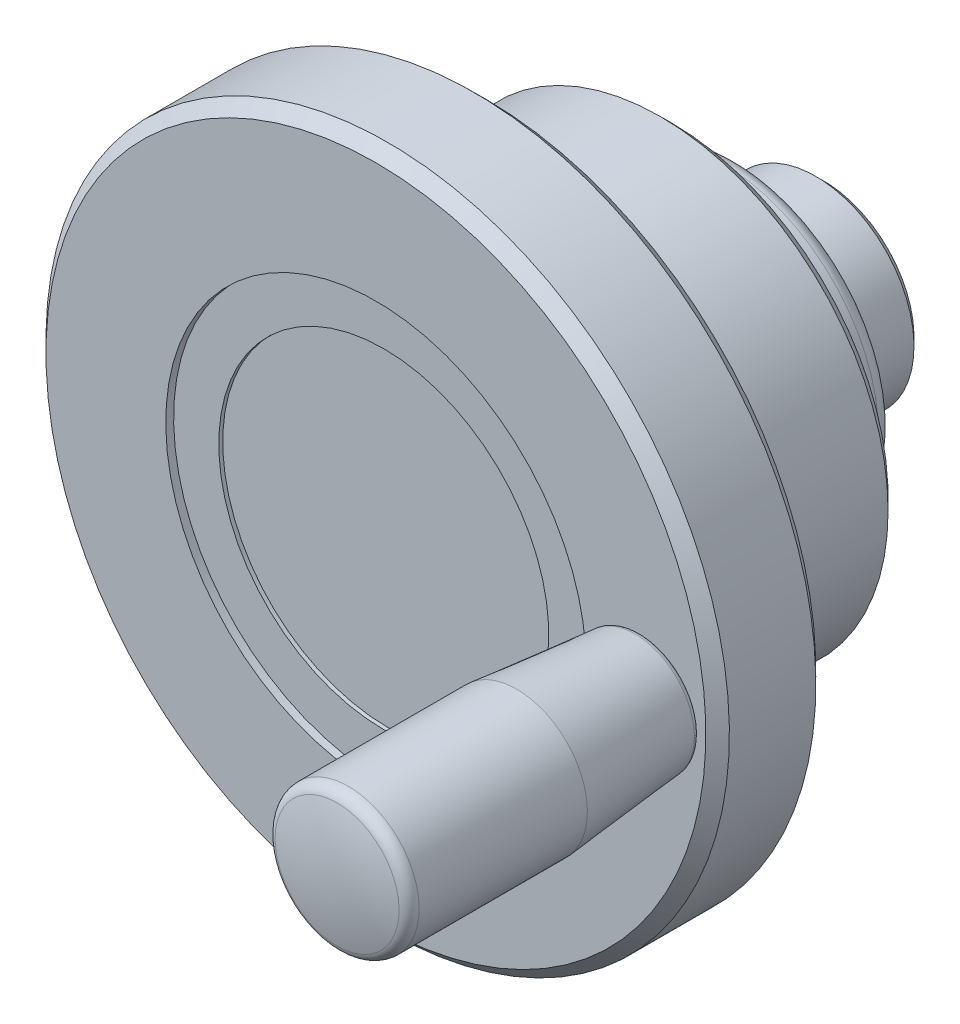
ISO-10303-21;
HEADER;
FILE_DESCRIPTION(('STEP AP214'),'2;1');
FILE_NAME('part.step','',(''),(''),'','','');
FILE_SCHEMA(('AUTOMOTIVE_DESIGN { 1 0 10303 214 1 1 1 1 }'));
ENDSEC;
DATA;
#1=APPLICATION_CONTEXT('core data for automotive mechanical design processes');
#2=APPLICATION_PROTOCOL_DEFINITION('international standard','automotive_design',2000,#1);
#3=PRODUCT_CONTEXT('',#1,'mechanical');
#4=PRODUCT('Part','Part','',(#3));
#5=PRODUCT_RELATED_PRODUCT_CATEGORY('part','',(#4));
#6=PRODUCT_DEFINITION_FORMATION('','',#4);
#7=PRODUCT_DEFINITION_CONTEXT('part definition',#1,'design');
#8=PRODUCT_DEFINITION('design','',#6,#7);
#9=PRODUCT_DEFINITION_SHAPE('','',#8);
#10=(LENGTH_UNIT() NAMED_UNIT(*) SI_UNIT(.MILLI.,.METRE.));
#11=(NAMED_UNIT(*) PLANE_ANGLE_UNIT() SI_UNIT($,.RADIAN.));
#12=(NAMED_UNIT(*) SI_UNIT($,.STERADIAN.) SOLID_ANGLE_UNIT());
#13=UNCERTAINTY_MEASURE_WITH_UNIT(LENGTH_MEASURE(1.E-05),#10,'distance_accuracy_value','');
#14=(GEOMETRIC_REPRESENTATION_CONTEXT(3) GLOBAL_UNCERTAINTY_ASSIGNED_CONTEXT((#13)) GLOBAL_UNIT_ASSIGNED_CONTEXT((#10,
#11,#12)) REPRESENTATION_CONTEXT('',''));
#15=CARTESIAN_POINT('',(0.,0.,0.));
#16=DIRECTION('',(0.,0.,1.));
#17=DIRECTION('',(1.,0.,0.));
#18=AXIS2_PLACEMENT_3D('',#15,#16,#17);
#19=CARTESIAN_POINT('',(-42.,0.,57.));
#20=DIRECTION('',(0.,0.,-1.));
#21=DIRECTION('',(0.,1.,0.));
#22=AXIS2_PLACEMENT_3D('',#19,#20,#21);
#23=PLANE('',#22);
#24=CARTESIAN_POINT('',(0.,0.,57.));
#25=DIRECTION('',(0.,0.,1.));
#26=DIRECTION('',(0.,-1.,0.));
#27=AXIS2_PLACEMENT_3D('',#24,#25,#26);
#28=CIRCLE('',#27,42.);
#29=CARTESIAN_POINT('',(0.,-42.,57.));
#30=VERTEX_POINT('',#29);
#31=EDGE_CURVE('E16',#30,#30,#28,.T.);
#32=ORIENTED_EDGE('',*,*,#31,.T.);
#33=EDGE_LOOP('',(#32));
#34=FACE_BOUND('',#33,.T.);
#35=CARTESIAN_POINT('',(0.,0.,57.));
#36=DIRECTION('',(0.,0.,1.));
#37=DIRECTION('',(0.,-1.,0.));
#38=AXIS2_PLACEMENT_3D('',#35,#36,#37);
#39=CIRCLE('',#38,26.75);
#40=CARTESIAN_POINT('',(0.,-26.75,57.));
#41=VERTEX_POINT('',#40);
#42=EDGE_CURVE('E50',#41,#41,#39,.T.);
#43=ORIENTED_EDGE('',*,*,#42,.F.);
#44=EDGE_LOOP('',(#43));
#45=FACE_BOUND('',#44,.T.);
#46=CARTESIAN_POINT('',(34.,0.,57.));
#47=DIRECTION('',(0.,0.,1.));
#48=DIRECTION('',(0.,-1.,0.));
#49=AXIS2_PLACEMENT_3D('',#46,#47,#48);
#50=CIRCLE('',#49,5.);
#51=CARTESIAN_POINT('',(34.,-5.,57.));
#52=VERTEX_POINT('',#51);
#53=EDGE_CURVE('E8',#52,#52,#50,.T.);
#54=ORIENTED_EDGE('',*,*,#53,.F.);
#55=EDGE_LOOP('',(#54));
#56=FACE_BOUND('',#55,.T.);
#57=ADVANCED_FACE('F12',(#34,#45,#56),#23,.F.);
#58=CARTESIAN_POINT('',(0.,0.,0.));
#59=DIRECTION('',(0.,0.,1.));
#60=DIRECTION('',(0.,-1.,0.));
#61=AXIS2_PLACEMENT_3D('',#58,#59,#60);
#62=PLANE('',#61);
#63=CARTESIAN_POINT('',(0.,0.,0.));
#64=DIRECTION('',(0.,0.,1.));
#65=DIRECTION('',(0.,-1.,0.));
#66=AXIS2_PLACEMENT_3D('',#63,#64,#65);
#67=CIRCLE('',#66,11.5);
#68=CARTESIAN_POINT('',(0.,-11.5,0.));
#69=VERTEX_POINT('',#68);
#70=EDGE_CURVE('E56',#69,#69,#67,.T.);
#71=ORIENTED_EDGE('',*,*,#70,.F.);
#72=EDGE_LOOP('',(#71));
#73=FACE_BOUND('',#72,.T.);
#74=ADVANCED_FACE('F14',(#73),#62,.F.);
#75=CARTESIAN_POINT('',(0.,0.,55.5));
#76=DIRECTION('',(0.,0.,-1.));
#77=DIRECTION('',(0.,1.,0.));
#78=AXIS2_PLACEMENT_3D('',#75,#76,#77);
#79=CONICAL_SURFACE('',#78,43.5,0.785398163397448);
#80=ORIENTED_EDGE('',*,*,#31,.F.);
#81=EDGE_LOOP('',(#80));
#82=FACE_BOUND('',#81,.T.);
#83=CARTESIAN_POINT('',(0.,0.,55.5));
#84=DIRECTION('',(0.,0.,1.));
#85=DIRECTION('',(0.,-1.,0.));
#86=AXIS2_PLACEMENT_3D('',#83,#84,#85);
#87=CIRCLE('',#86,43.5);
#88=CARTESIAN_POINT('',(0.,-43.5,55.5));
#89=VERTEX_POINT('',#88);
#90=EDGE_CURVE('E24',#89,#89,#87,.T.);
#91=ORIENTED_EDGE('',*,*,#90,.T.);
#92=EDGE_LOOP('',(#91));
#93=FACE_BOUND('',#92,.T.);
#94=ADVANCED_FACE('F97',(#82,#93),#79,.T.);
#95=CARTESIAN_POINT('',(0.,0.,70.104900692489));
#96=DIRECTION('',(0.,0.,1.));
#97=DIRECTION('',(0.,-1.,0.));
#98=AXIS2_PLACEMENT_3D('',#95,#96,#97);
#99=CYLINDRICAL_SURFACE('',#98,43.5);
#100=ORIENTED_EDGE('',*,*,#90,.F.);
#101=EDGE_LOOP('',(#100));
#102=FACE_BOUND('',#101,.T.);
#103=CARTESIAN_POINT('',(0.,0.,44.5));
#104=DIRECTION('',(0.,0.,1.));
#105=DIRECTION('',(0.,-1.,0.));
#106=AXIS2_PLACEMENT_3D('',#103,#104,#105);
#107=CIRCLE('',#106,43.5);
#108=CARTESIAN_POINT('',(0.,-43.5,44.5));
#109=VERTEX_POINT('',#108);
#110=EDGE_CURVE('E92',#109,#109,#107,.T.);
#111=ORIENTED_EDGE('',*,*,#110,.T.);
#112=EDGE_LOOP('',(#111));
#113=FACE_BOUND('',#112,.T.);
#114=ADVANCED_FACE('F99',(#102,#113),#99,.T.);
#115=CARTESIAN_POINT('',(0.,0.,43.));
#116=DIRECTION('',(0.,0.,1.));
#117=DIRECTION('',(0.,-1.,0.));
#118=AXIS2_PLACEMENT_3D('',#115,#116,#117);
#119=CONICAL_SURFACE('',#118,42.,0.785398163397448);
#120=ORIENTED_EDGE('',*,*,#110,.F.);
#121=EDGE_LOOP('',(#120));
#122=FACE_BOUND('',#121,.T.);
#123=CARTESIAN_POINT('',(0.,0.,43.));
#124=DIRECTION('',(0.,0.,1.));
#125=DIRECTION('',(0.,-1.,0.));
#126=AXIS2_PLACEMENT_3D('',#123,#124,#125);
#127=CIRCLE('',#126,42.);
#128=CARTESIAN_POINT('',(0.,-42.,43.));
#129=VERTEX_POINT('',#128);
#130=EDGE_CURVE('E89',#129,#129,#127,.T.);
#131=ORIENTED_EDGE('',*,*,#130,.T.);
#132=EDGE_LOOP('',(#131));
#133=FACE_BOUND('',#132,.T.);
#134=ADVANCED_FACE('F102',(#122,#133),#119,.T.);
#135=CARTESIAN_POINT('',(-42.,0.,43.));
#136=DIRECTION('',(0.,0.,-1.));
#137=DIRECTION('',(0.,1.,0.));
#138=AXIS2_PLACEMENT_3D('',#135,#136,#137);
#139=PLANE('',#138);
#140=CARTESIAN_POINT('',(0.,0.,43.));
#141=DIRECTION('',(0.,0.,1.));
#142=DIRECTION('',(0.,-1.,0.));
#143=AXIS2_PLACEMENT_3D('',#140,#141,#142);
#144=CIRCLE('',#143,31.);
#145=CARTESIAN_POINT('',(0.,-31.,43.));
#146=VERTEX_POINT('',#145);
#147=EDGE_CURVE('E86',#146,#146,#144,.T.);
#148=ORIENTED_EDGE('',*,*,#147,.T.);
#149=EDGE_LOOP('',(#148));
#150=FACE_BOUND('',#149,.T.);
#151=ORIENTED_EDGE('',*,*,#130,.F.);
#152=EDGE_LOOP('',(#151));
#153=FACE_BOUND('',#152,.T.);
#154=ADVANCED_FACE('F108',(#150,#153),#139,.T.);
#155=CARTESIAN_POINT('',(0.,0.,41.));
#156=DIRECTION('',(0.,0.,1.));
#157=DIRECTION('',(0.,-1.,0.));
#158=AXIS2_PLACEMENT_3D('',#155,#156,#157);
#159=TOROIDAL_SURFACE('',#158,31.,2.);
#160=ORIENTED_EDGE('',*,*,#147,.F.);
#161=EDGE_LOOP('',(#160));
#162=FACE_BOUND('',#161,.T.);
#163=CARTESIAN_POINT('',(0.,0.,41.));
#164=DIRECTION('',(0.,0.,1.));
#165=DIRECTION('',(0.,-1.,0.));
#166=AXIS2_PLACEMENT_3D('',#163,#164,#165);
#167=CIRCLE('',#166,29.);
#168=CARTESIAN_POINT('',(0.,-29.,41.));
#169=VERTEX_POINT('',#168);
#170=EDGE_CURVE('E83',#169,#169,#167,.T.);
#171=ORIENTED_EDGE('',*,*,#170,.T.);
#172=EDGE_LOOP('',(#171));
#173=FACE_BOUND('',#172,.T.);
#174=ADVANCED_FACE('F113',(#162,#173),#159,.F.);
#175=CARTESIAN_POINT('',(0.,0.,70.104900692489));
#176=DIRECTION('',(0.,0.,1.));
#177=DIRECTION('',(0.,-1.,0.));
#178=AXIS2_PLACEMENT_3D('',#175,#176,#177);
#179=CYLINDRICAL_SURFACE('',#178,29.);
#180=CARTESIAN_POINT('',(0.,0.,20.8));
#181=DIRECTION('',(0.,0.,1.));
#182=DIRECTION('',(0.,-1.,0.));
#183=AXIS2_PLACEMENT_3D('',#180,#181,#182);
#184=CIRCLE('',#183,29.);
#185=CARTESIAN_POINT('',(0.,-29.,20.8));
#186=VERTEX_POINT('',#185);
#187=EDGE_CURVE('E80',#186,#186,#184,.T.);
#188=ORIENTED_EDGE('',*,*,#187,.T.);
#189=EDGE_LOOP('',(#188));
#190=FACE_BOUND('',#189,.T.);
#191=ORIENTED_EDGE('',*,*,#170,.F.);
#192=EDGE_LOOP('',(#191));
#193=FACE_BOUND('',#192,.T.);
#194=ADVANCED_FACE('F121',(#190,#193),#179,.T.);
#195=CARTESIAN_POINT('',(0.,0.,19.3));
#196=DIRECTION('',(0.,0.,1.));
#197=DIRECTION('',(0.,-1.,0.));
#198=AXIS2_PLACEMENT_3D('',#195,#196,#197);
#199=CONICAL_SURFACE('',#198,27.5,0.785398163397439);
#200=ORIENTED_EDGE('',*,*,#187,.F.);
#201=EDGE_LOOP('',(#200));
#202=FACE_BOUND('',#201,.T.);
#203=CARTESIAN_POINT('',(0.,0.,19.3));
#204=DIRECTION('',(0.,0.,1.));
#205=DIRECTION('',(0.,-1.,0.));
#206=AXIS2_PLACEMENT_3D('',#203,#204,#205);
#207=CIRCLE('',#206,27.5);
#208=CARTESIAN_POINT('',(0.,-27.5,19.3));
#209=VERTEX_POINT('',#208);
#210=EDGE_CURVE('E77',#209,#209,#207,.T.);
#211=ORIENTED_EDGE('',*,*,#210,.T.);
#212=EDGE_LOOP('',(#211));
#213=FACE_BOUND('',#212,.T.);
#214=ADVANCED_FACE('F185',(#202,#213),#199,.T.);
#215=CARTESIAN_POINT('',(-22.,0.,19.3));
#216=DIRECTION('',(0.,0.,1.));
#217=DIRECTION('',(0.,-1.,0.));
#218=AXIS2_PLACEMENT_3D('',#215,#216,#217);
#219=PLANE('',#218);
#220=ORIENTED_EDGE('',*,*,#210,.F.);
#221=EDGE_LOOP('',(#220));
#222=FACE_BOUND('',#221,.T.);
#223=CARTESIAN_POINT('',(0.,0.,19.3));
#224=DIRECTION('',(0.,0.,1.));
#225=DIRECTION('',(0.,-1.,0.));
#226=AXIS2_PLACEMENT_3D('',#223,#224,#225);
#227=CIRCLE('',#226,22.);
#228=CARTESIAN_POINT('',(0.,-22.,19.3));
#229=VERTEX_POINT('',#228);
#230=EDGE_CURVE('E74',#229,#229,#227,.T.);
#231=ORIENTED_EDGE('',*,*,#230,.T.);
#232=EDGE_LOOP('',(#231));
#233=FACE_BOUND('',#232,.T.);
#234=ADVANCED_FACE('F193',(#222,#233),#219,.F.);
#235=CARTESIAN_POINT('',(0.,0.,17.3));
#236=DIRECTION('',(0.,0.,1.));
#237=DIRECTION('',(0.,-1.,0.));
#238=AXIS2_PLACEMENT_3D('',#235,#236,#237);
#239=TOROIDAL_SURFACE('',#238,22.,2.);
#240=ORIENTED_EDGE('',*,*,#230,.F.);
#241=EDGE_LOOP('',(#240));
#242=FACE_BOUND('',#241,.T.);
#243=CARTESIAN_POINT('',(0.,0.,17.3));
#244=DIRECTION('',(0.,0.,1.));
#245=DIRECTION('',(0.,-1.,0.));
#246=AXIS2_PLACEMENT_3D('',#243,#244,#245);
#247=CIRCLE('',#246,20.);
#248=CARTESIAN_POINT('',(0.,-20.,17.3));
#249=VERTEX_POINT('',#248);
#250=EDGE_CURVE('E71',#249,#249,#247,.T.);
#251=ORIENTED_EDGE('',*,*,#250,.T.);
#252=EDGE_LOOP('',(#251));
#253=FACE_BOUND('',#252,.T.);
#254=ADVANCED_FACE('F202',(#242,#253),#239,.F.);
#255=CARTESIAN_POINT('',(0.,0.,70.104900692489));
#256=DIRECTION('',(0.,0.,1.));
#257=DIRECTION('',(0.,-1.,0.));
#258=AXIS2_PLACEMENT_3D('',#255,#256,#257);
#259=CYLINDRICAL_SURFACE('',#258,20.);
#260=CARTESIAN_POINT('',(0.,0.,13.));
#261=DIRECTION('',(0.,0.,1.));
#262=DIRECTION('',(0.,-1.,0.));
#263=AXIS2_PLACEMENT_3D('',#260,#261,#262);
#264=CIRCLE('',#263,20.);
#265=CARTESIAN_POINT('',(0.,-20.,13.));
#266=VERTEX_POINT('',#265);
#267=EDGE_CURVE('E68',#266,#266,#264,.T.);
#268=ORIENTED_EDGE('',*,*,#267,.T.);
#269=EDGE_LOOP('',(#268));
#270=FACE_BOUND('',#269,.T.);
#271=ORIENTED_EDGE('',*,*,#250,.F.);
#272=EDGE_LOOP('',(#271));
#273=FACE_BOUND('',#272,.T.);
#274=ADVANCED_FACE('F211',(#270,#273),#259,.T.);
#275=CARTESIAN_POINT('',(0.,0.,13.));
#276=DIRECTION('',(0.,0.,1.));
#277=DIRECTION('',(0.,-1.,0.));
#278=AXIS2_PLACEMENT_3D('',#275,#276,#277);
#279=TOROIDAL_SURFACE('',#278,18.,1.99999999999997);
#280=CARTESIAN_POINT('',(0.,0.,11.));
#281=DIRECTION('',(0.,0.,1.));
#282=DIRECTION('',(0.,-1.,0.));
#283=AXIS2_PLACEMENT_3D('',#280,#281,#282);
#284=CIRCLE('',#283,18.);
#285=CARTESIAN_POINT('',(0.,-18.,11.));
#286=VERTEX_POINT('',#285);
#287=EDGE_CURVE('E65',#286,#286,#284,.T.);
#288=ORIENTED_EDGE('',*,*,#287,.T.);
#289=EDGE_LOOP('',(#288));
#290=FACE_BOUND('',#289,.T.);
#291=ORIENTED_EDGE('',*,*,#267,.F.);
#292=EDGE_LOOP('',(#291));
#293=FACE_BOUND('',#292,.T.);
#294=ADVANCED_FACE('F220',(#290,#293),#279,.T.);
#295=CARTESIAN_POINT('',(-12.5,0.,11.));
#296=DIRECTION('',(0.,0.,1.));
#297=DIRECTION('',(0.,-1.,0.));
#298=AXIS2_PLACEMENT_3D('',#295,#296,#297);
#299=PLANE('',#298);
#300=ORIENTED_EDGE('',*,*,#287,.F.);
#301=EDGE_LOOP('',(#300));
#302=FACE_BOUND('',#301,.T.);
#303=CARTESIAN_POINT('',(0.,0.,11.));
#304=DIRECTION('',(0.,0.,1.));
#305=DIRECTION('',(0.,-1.,0.));
#306=AXIS2_PLACEMENT_3D('',#303,#304,#305);
#307=CIRCLE('',#306,12.5);
#308=CARTESIAN_POINT('',(0.,-12.5,11.));
#309=VERTEX_POINT('',#308);
#310=EDGE_CURVE('E62',#309,#309,#307,.T.);
#311=ORIENTED_EDGE('',*,*,#310,.T.);
#312=EDGE_LOOP('',(#311));
#313=FACE_BOUND('',#312,.T.);
#314=ADVANCED_FACE('F229',(#302,#313),#299,.F.);
#315=CARTESIAN_POINT('',(0.,0.,70.104900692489));
#316=DIRECTION('',(0.,0.,1.));
#317=DIRECTION('',(0.,-1.,0.));
#318=AXIS2_PLACEMENT_3D('',#315,#316,#317);
#319=CYLINDRICAL_SURFACE('',#318,12.5);
#320=CARTESIAN_POINT('',(0.,0.,1.));
#321=DIRECTION('',(0.,0.,1.));
#322=DIRECTION('',(0.,-1.,0.));
#323=AXIS2_PLACEMENT_3D('',#320,#321,#322);
#324=CIRCLE('',#323,12.5);
#325=CARTESIAN_POINT('',(0.,-12.5,1.));
#326=VERTEX_POINT('',#325);
#327=EDGE_CURVE('E59',#326,#326,#324,.T.);
#328=ORIENTED_EDGE('',*,*,#327,.T.);
#329=EDGE_LOOP('',(#328));
#330=FACE_BOUND('',#329,.T.);
#331=ORIENTED_EDGE('',*,*,#310,.F.);
#332=EDGE_LOOP('',(#331));
#333=FACE_BOUND('',#332,.T.);
#334=ADVANCED_FACE('F238',(#330,#333),#319,.T.);
#335=CARTESIAN_POINT('',(0.,0.,0.));
#336=DIRECTION('',(0.,0.,1.));
#337=DIRECTION('',(0.,-1.,0.));
#338=AXIS2_PLACEMENT_3D('',#335,#336,#337);
#339=CONICAL_SURFACE('',#338,11.5,0.785398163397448);
#340=ORIENTED_EDGE('',*,*,#327,.F.);
#341=EDGE_LOOP('',(#340));
#342=FACE_BOUND('',#341,.T.);
#343=ORIENTED_EDGE('',*,*,#70,.T.);
#344=EDGE_LOOP('',(#343));
#345=FACE_BOUND('',#344,.T.);
#346=ADVANCED_FACE('F247',(#342,#345),#339,.T.);
#347=CARTESIAN_POINT('',(0.,0.,56.));
#348=DIRECTION('',(0.,0.,1.));
#349=DIRECTION('',(0.,-1.,0.));
#350=AXIS2_PLACEMENT_3D('',#347,#348,#349);
#351=CYLINDRICAL_SURFACE('',#350,26.75);
#352=CARTESIAN_POINT('',(0.,0.,56.));
#353=DIRECTION('',(0.,0.,1.));
#354=DIRECTION('',(0.,-1.,0.));
#355=AXIS2_PLACEMENT_3D('',#352,#353,#354);
#356=CIRCLE('',#355,26.75);
#357=CARTESIAN_POINT('',(0.,-26.75,56.));
#358=VERTEX_POINT('',#357);
#359=EDGE_CURVE('E53',#358,#358,#356,.T.);
#360=ORIENTED_EDGE('',*,*,#359,.F.);
#361=EDGE_LOOP('',(#360));
#362=FACE_BOUND('',#361,.T.);
#363=ORIENTED_EDGE('',*,*,#42,.T.);
#364=EDGE_LOOP('',(#363));
#365=FACE_BOUND('',#364,.T.);
#366=ADVANCED_FACE('F256',(#362,#365),#351,.F.);
#367=CARTESIAN_POINT('',(0.,0.,56.));
#368=DIRECTION('',(0.,0.,1.));
#369=DIRECTION('',(0.,-1.,0.));
#370=AXIS2_PLACEMENT_3D('',#367,#368,#369);
#371=PLANE('',#370);
#372=CARTESIAN_POINT('',(0.,0.,56.));
#373=DIRECTION('',(0.,0.,1.));
#374=DIRECTION('',(0.,-1.,0.));
#375=AXIS2_PLACEMENT_3D('',#372,#373,#374);
#376=CIRCLE('',#375,21.);
#377=CARTESIAN_POINT('',(0.,-21.,56.));
#378=VERTEX_POINT('',#377);
#379=EDGE_CURVE('E47',#378,#378,#376,.T.);
#380=ORIENTED_EDGE('',*,*,#379,.F.);
#381=EDGE_LOOP('',(#380));
#382=FACE_BOUND('',#381,.T.);
#383=ORIENTED_EDGE('',*,*,#359,.T.);
#384=EDGE_LOOP('',(#383));
#385=FACE_BOUND('',#384,.T.);
#386=ADVANCED_FACE('F259',(#382,#385),#371,.T.);
#387=CARTESIAN_POINT('',(0.,0.,55.5));
#388=DIRECTION('',(0.,0.,1.));
#389=DIRECTION('',(0.,-1.,0.));
#390=AXIS2_PLACEMENT_3D('',#387,#388,#389);
#391=CYLINDRICAL_SURFACE('',#390,21.);
#392=ORIENTED_EDGE('',*,*,#379,.T.);
#393=EDGE_LOOP('',(#392));
#394=FACE_BOUND('',#393,.T.);
#395=CARTESIAN_POINT('',(0.,0.,55.5));
#396=DIRECTION('',(0.,0.,1.));
#397=DIRECTION('',(0.,-1.,0.));
#398=AXIS2_PLACEMENT_3D('',#395,#396,#397);
#399=CIRCLE('',#398,21.);
#400=CARTESIAN_POINT('',(0.,-21.,55.5));
#401=VERTEX_POINT('',#400);
#402=EDGE_CURVE('E44',#401,#401,#399,.T.);
#403=ORIENTED_EDGE('',*,*,#402,.F.);
#404=EDGE_LOOP('',(#403));
#405=FACE_BOUND('',#404,.T.);
#406=ADVANCED_FACE('F275',(#394,#405),#391,.F.);
#407=CARTESIAN_POINT('',(0.,0.,55.5));
#408=DIRECTION('',(0.,0.,1.));
#409=DIRECTION('',(0.,-1.,0.));
#410=AXIS2_PLACEMENT_3D('',#407,#408,#409);
#411=PLANE('',#410);
#412=ORIENTED_EDGE('',*,*,#402,.T.);
#413=EDGE_LOOP('',(#412));
#414=FACE_BOUND('',#413,.T.);
#415=ADVANCED_FACE('F268',(#414),#411,.T.);
#416=CARTESIAN_POINT('',(34.,0.,67.));
#417=DIRECTION('',(0.,-1.,0.));
#418=DIRECTION('',(0.,0.,-1.));
#419=AXIS2_PLACEMENT_3D('',#416,#417,#418);
#420=SPHERICAL_SURFACE('',#419,30.);
#421=CARTESIAN_POINT('',(34.,0.,67.));
#422=DIRECTION('',(0.,0.,1.));
#423=DIRECTION('',(0.,-1.,0.));
#424=AXIS2_PLACEMENT_3D('',#421,#422,#423);
#425=SPHERICAL_SURFACE('',#424,30.);
#426=CARTESIAN_POINT('',(34.,0.,95.942583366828));
#427=DIRECTION('',(0.,0.,1.));
#428=DIRECTION('',(0.,-1.,0.));
#429=AXIS2_PLACEMENT_3D('',#426,#427,#428);
#430=CIRCLE('',#429,7.89473673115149);
#431=CARTESIAN_POINT('',(34.,-7.89473673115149,95.942583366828));
#432=VERTEX_POINT('',#431);
#433=EDGE_CURVE('E41',#432,#432,#430,.T.);
#434=ORIENTED_EDGE('',*,*,#433,.T.);
#435=EDGE_LOOP('',(#434));
#436=FACE_BOUND('',#435,.T.);
#437=ADVANCED_FACE('F286',(#436),#425,.T.);
#438=CARTESIAN_POINT('',(34.,0.,94.495454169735));
#439=DIRECTION('',(0.,0.,1.));
#440=DIRECTION('',(0.,-1.,0.));
#441=AXIS2_PLACEMENT_3D('',#438,#439,#440);
#442=TOROIDAL_SURFACE('',#441,7.5,1.49999999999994);
#443=CARTESIAN_POINT('',(34.,0.,94.495454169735));
#444=DIRECTION('',(0.,0.,1.));
#445=DIRECTION('',(0.,-1.,0.));
#446=AXIS2_PLACEMENT_3D('',#443,#444,#445);
#447=CIRCLE('',#446,9.);
#448=CARTESIAN_POINT('',(34.,-9.,94.495454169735));
#449=VERTEX_POINT('',#448);
#450=EDGE_CURVE('E38',#449,#449,#447,.T.);
#451=ORIENTED_EDGE('',*,*,#450,.T.);
#452=EDGE_LOOP('',(#451));
#453=FACE_BOUND('',#452,.T.);
#454=ORIENTED_EDGE('',*,*,#433,.F.);
#455=EDGE_LOOP('',(#454));
#456=FACE_BOUND('',#455,.T.);
#457=ADVANCED_FACE('F301',(#453,#456),#442,.T.);
#458=CARTESIAN_POINT('',(34.,0.,107.358047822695));
#459=DIRECTION('',(0.,0.,1.));
#460=DIRECTION('',(0.,-1.,0.));
#461=AXIS2_PLACEMENT_3D('',#458,#459,#460);
#462=CYLINDRICAL_SURFACE('',#461,9.);
#463=CARTESIAN_POINT('',(34.,0.,73.0801493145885));
#464=DIRECTION('',(0.,0.,1.));
#465=DIRECTION('',(0.,-1.,0.));
#466=AXIS2_PLACEMENT_3D('',#463,#464,#465);
#467=CIRCLE('',#466,9.);
#468=CARTESIAN_POINT('',(34.,-9.,73.0801493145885));
#469=VERTEX_POINT('',#468);
#470=EDGE_CURVE('E35',#469,#469,#467,.T.);
#471=ORIENTED_EDGE('',*,*,#470,.T.);
#472=EDGE_LOOP('',(#471));
#473=FACE_BOUND('',#472,.T.);
#474=ORIENTED_EDGE('',*,*,#450,.F.);
#475=EDGE_LOOP('',(#474));
#476=FACE_BOUND('',#475,.T.);
#477=ADVANCED_FACE('F310',(#473,#476),#462,.T.);
#478=CARTESIAN_POINT('',(34.,0.,58.024296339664));
#479=DIRECTION('',(0.,0.,1.));
#480=DIRECTION('',(0.,-1.,0.));
#481=AXIS2_PLACEMENT_3D('',#478,#479,#480);
#482=CONICAL_SURFACE('',#481,7.56884881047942,0.0947713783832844);
#483=ORIENTED_EDGE('',*,*,#470,.F.);
#484=EDGE_LOOP('',(#483));
#485=FACE_BOUND('',#484,.T.);
#486=CARTESIAN_POINT('',(34.,0.,58.024296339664));
#487=DIRECTION('',(0.,0.,1.));
#488=DIRECTION('',(0.,-1.,0.));
#489=AXIS2_PLACEMENT_3D('',#486,#487,#488);
#490=CIRCLE('',#489,7.56884881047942);
#491=CARTESIAN_POINT('',(34.,-7.56884881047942,58.024296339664));
#492=VERTEX_POINT('',#491);
#493=EDGE_CURVE('E32',#492,#492,#490,.T.);
#494=ORIENTED_EDGE('',*,*,#493,.T.);
#495=EDGE_LOOP('',(#494));
#496=FACE_BOUND('',#495,.T.);
#497=ADVANCED_FACE('F319',(#485,#496),#482,.T.);
#498=CARTESIAN_POINT('',(34.,0.,58.1));
#499=DIRECTION('',(0.,0.,1.));
#500=DIRECTION('',(0.,-1.,0.));
#501=AXIS2_PLACEMENT_3D('',#498,#499,#500);
#502=TOROIDAL_SURFACE('',#501,6.77243876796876,0.800000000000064);
#503=CARTESIAN_POINT('',(34.,0.,57.3));
#504=DIRECTION('',(0.,0.,1.));
#505=DIRECTION('',(0.,-1.,0.));
#506=AXIS2_PLACEMENT_3D('',#503,#504,#505);
#507=CIRCLE('',#506,6.77243876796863);
#508=CARTESIAN_POINT('',(34.,-6.77243876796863,57.3));
#509=VERTEX_POINT('',#508);
#510=EDGE_CURVE('E29',#509,#509,#507,.T.);
#511=ORIENTED_EDGE('',*,*,#510,.T.);
#512=EDGE_LOOP('',(#511));
#513=FACE_BOUND('',#512,.T.);
#514=ORIENTED_EDGE('',*,*,#493,.F.);
#515=EDGE_LOOP('',(#514));
#516=FACE_BOUND('',#515,.T.);
#517=ADVANCED_FACE('F328',(#513,#516),#502,.T.);
#518=CARTESIAN_POINT('',(29.,0.,57.3));
#519=DIRECTION('',(0.,0.,1.));
#520=DIRECTION('',(0.,-1.,0.));
#521=AXIS2_PLACEMENT_3D('',#518,#519,#520);
#522=PLANE('',#521);
#523=ORIENTED_EDGE('',*,*,#510,.F.);
#524=EDGE_LOOP('',(#523));
#525=FACE_BOUND('',#524,.T.);
#526=CARTESIAN_POINT('',(34.,0.,57.3));
#527=DIRECTION('',(0.,0.,1.));
#528=DIRECTION('',(0.,-1.,0.));
#529=AXIS2_PLACEMENT_3D('',#526,#527,#528);
#530=CIRCLE('',#529,5.);
#531=CARTESIAN_POINT('',(34.,-5.,57.3));
#532=VERTEX_POINT('',#531);
#533=EDGE_CURVE('E26',#532,#532,#530,.T.);
#534=ORIENTED_EDGE('',*,*,#533,.T.);
#535=EDGE_LOOP('',(#534));
#536=FACE_BOUND('',#535,.T.);
#537=ADVANCED_FACE('F337',(#525,#536),#522,.F.);
#538=CARTESIAN_POINT('',(34.,0.,107.358047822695));
#539=DIRECTION('',(0.,0.,1.));
#540=DIRECTION('',(0.,-1.,0.));
#541=AXIS2_PLACEMENT_3D('',#538,#539,#540);
#542=CYLINDRICAL_SURFACE('',#541,5.);
#543=ORIENTED_EDGE('',*,*,#533,.F.);
#544=EDGE_LOOP('',(#543));
#545=FACE_BOUND('',#544,.T.);
#546=ORIENTED_EDGE('',*,*,#53,.T.);
#547=EDGE_LOOP('',(#546));
#548=FACE_BOUND('',#547,.T.);
#549=ADVANCED_FACE('F346',(#545,#548),#542,.T.);
#550=CLOSED_SHELL('',(#57,#74,#94,#114,#134,#154,#174,#194,#214,#234,#254,#274,#294,#314,#334,
#346,#366,#386,#406,#415,#437,#457,#477,#497,#517,#537,#549));
#551=MANIFOLD_SOLID_BREP('B1',#550);
#552=ADVANCED_BREP_SHAPE_REPRESENTATION('',(#18,#551),#14);
#553=SHAPE_DEFINITION_REPRESENTATION(#9,#552);
ENDSEC;
END-ISO-10303-21;
